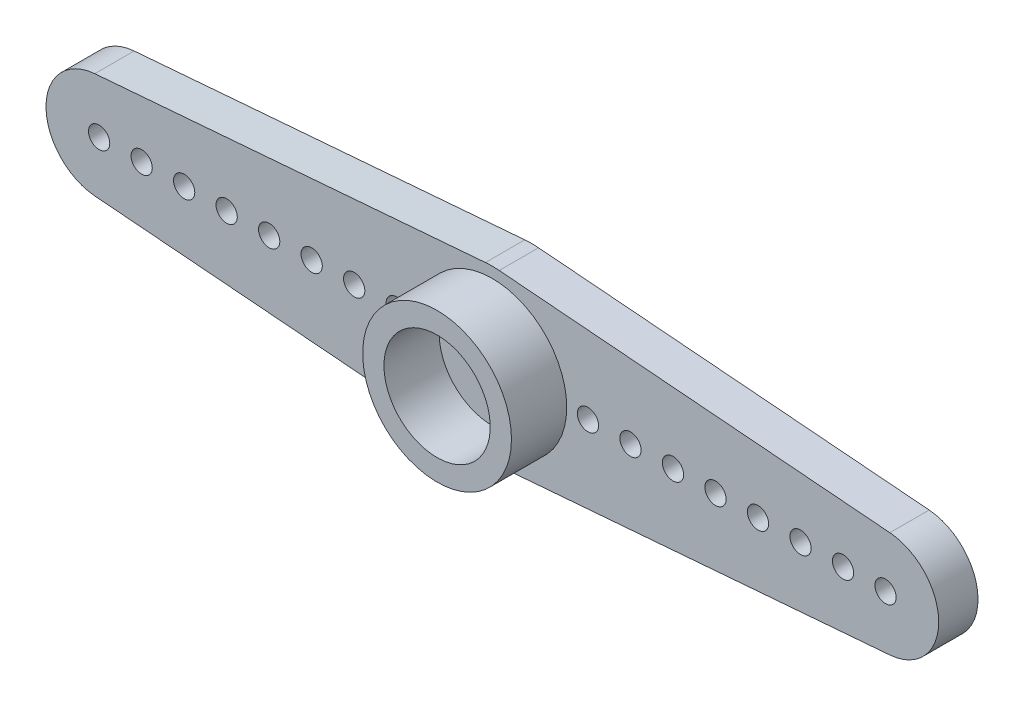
ISO-10303-21;
HEADER;
FILE_DESCRIPTION(('STEP AP214'),'2;1');
FILE_NAME('part.step','',(''),(''),'','','');
FILE_SCHEMA(('AUTOMOTIVE_DESIGN { 1 0 10303 214 1 1 1 1 }'));
ENDSEC;
DATA;
#1=APPLICATION_CONTEXT('core data for automotive mechanical design processes');
#2=APPLICATION_PROTOCOL_DEFINITION('international standard','automotive_design',2000,#1);
#3=PRODUCT_CONTEXT('',#1,'mechanical');
#4=PRODUCT('Part','Part','',(#3));
#5=PRODUCT_RELATED_PRODUCT_CATEGORY('part','',(#4));
#6=PRODUCT_DEFINITION_FORMATION('','',#4);
#7=PRODUCT_DEFINITION_CONTEXT('part definition',#1,'design');
#8=PRODUCT_DEFINITION('design','',#6,#7);
#9=PRODUCT_DEFINITION_SHAPE('','',#8);
#10=(LENGTH_UNIT() NAMED_UNIT(*) SI_UNIT(.MILLI.,.METRE.));
#11=(NAMED_UNIT(*) PLANE_ANGLE_UNIT() SI_UNIT($,.RADIAN.));
#12=(NAMED_UNIT(*) SI_UNIT($,.STERADIAN.) SOLID_ANGLE_UNIT());
#13=UNCERTAINTY_MEASURE_WITH_UNIT(LENGTH_MEASURE(1.E-05),#10,'distance_accuracy_value','');
#14=(GEOMETRIC_REPRESENTATION_CONTEXT(3) GLOBAL_UNCERTAINTY_ASSIGNED_CONTEXT((#13)) GLOBAL_UNIT_ASSIGNED_CONTEXT((#10,
#11,#12)) REPRESENTATION_CONTEXT('',''));
#15=CARTESIAN_POINT('',(0.,0.,0.));
#16=DIRECTION('',(0.,0.,1.));
#17=DIRECTION('',(1.,0.,0.));
#18=AXIS2_PLACEMENT_3D('',#15,#16,#17);
#19=CARTESIAN_POINT('',(0.,0.,0.));
#20=DIRECTION('',(0.,0.,1.));
#21=DIRECTION('',(1.,0.,0.));
#22=AXIS2_PLACEMENT_3D('',#19,#20,#21);
#23=PLANE('',#22);
#24=CARTESIAN_POINT('',(0.,0.,0.));
#25=DIRECTION('',(0.,0.,1.));
#26=DIRECTION('',(1.,0.,0.));
#27=AXIS2_PLACEMENT_3D('',#24,#25,#26);
#28=CIRCLE('',#27,4.);
#29=CARTESIAN_POINT('',(0.324324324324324,3.98683003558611,0.));
#30=VERTEX_POINT('',#29);
#31=CARTESIAN_POINT('',(-0.324324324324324,3.98683003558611,0.));
#32=VERTEX_POINT('',#31);
#33=EDGE_CURVE('E133',#30,#32,#28,.T.);
#34=ORIENTED_EDGE('',*,*,#33,.F.);
#35=DIRECTION('',(-0.996707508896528,0.0810810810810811,0.));
#36=VECTOR('',#35,1.);
#37=CARTESIAN_POINT('',(0.324324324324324,3.98683003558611,0.));
#38=LINE('',#37,#36);
#39=CARTESIAN_POINT('',(18.7027027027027,2.49176877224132,0.));
#40=VERTEX_POINT('',#39);
#41=EDGE_CURVE('E86',#40,#30,#38,.T.);
#42=ORIENTED_EDGE('',*,*,#41,.F.);
#43=CARTESIAN_POINT('',(18.5,0.,0.));
#44=DIRECTION('',(0.,0.,1.));
#45=DIRECTION('',(1.,0.,0.));
#46=AXIS2_PLACEMENT_3D('',#43,#44,#45);
#47=CIRCLE('',#46,2.5);
#48=CARTESIAN_POINT('',(18.7027027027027,-2.49176877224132,0.));
#49=VERTEX_POINT('',#48);
#50=EDGE_CURVE('E80',#49,#40,#47,.T.);
#51=ORIENTED_EDGE('',*,*,#50,.F.);
#52=DIRECTION('',(0.996707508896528,0.0810810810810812,0.));
#53=VECTOR('',#52,1.);
#54=CARTESIAN_POINT('',(18.7027027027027,-2.49176877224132,0.));
#55=LINE('',#54,#53);
#56=CARTESIAN_POINT('',(0.324324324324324,-3.98683003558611,0.));
#57=VERTEX_POINT('',#56);
#58=EDGE_CURVE('E123',#57,#49,#55,.T.);
#59=ORIENTED_EDGE('',*,*,#58,.F.);
#60=CARTESIAN_POINT('',(0.,0.,0.));
#61=DIRECTION('',(0.,0.,1.));
#62=DIRECTION('',(1.,0.,0.));
#63=AXIS2_PLACEMENT_3D('',#60,#61,#62);
#64=CIRCLE('',#63,4.);
#65=CARTESIAN_POINT('',(-0.324324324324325,-3.98683003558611,0.));
#66=VERTEX_POINT('',#65);
#67=EDGE_CURVE('E143',#66,#57,#64,.T.);
#68=ORIENTED_EDGE('',*,*,#67,.F.);
#69=DIRECTION('',(0.996707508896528,-0.0810810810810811,0.));
#70=VECTOR('',#69,1.);
#71=CARTESIAN_POINT('',(-0.324324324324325,-3.98683003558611,0.));
#72=LINE('',#71,#70);
#73=CARTESIAN_POINT('',(-18.7027027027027,-2.49176877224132,0.));
#74=VERTEX_POINT('',#73);
#75=EDGE_CURVE('E141',#74,#66,#72,.T.);
#76=ORIENTED_EDGE('',*,*,#75,.F.);
#77=CARTESIAN_POINT('',(-18.5,0.,0.));
#78=DIRECTION('',(0.,0.,1.));
#79=DIRECTION('',(1.,0.,0.));
#80=AXIS2_PLACEMENT_3D('',#77,#78,#79);
#81=CIRCLE('',#80,2.5);
#82=CARTESIAN_POINT('',(-18.7027027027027,2.49176877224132,0.));
#83=VERTEX_POINT('',#82);
#84=EDGE_CURVE('E139',#83,#74,#81,.T.);
#85=ORIENTED_EDGE('',*,*,#84,.F.);
#86=DIRECTION('',(-0.996707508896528,-0.0810810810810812,0.));
#87=VECTOR('',#86,1.);
#88=CARTESIAN_POINT('',(-18.7027027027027,2.49176877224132,0.));
#89=LINE('',#88,#87);
#90=EDGE_CURVE('E136',#32,#83,#89,.T.);
#91=ORIENTED_EDGE('',*,*,#90,.F.);
#92=EDGE_LOOP('',(#34,#42,#51,#59,#68,#76,#85,#91));
#93=FACE_BOUND('',#92,.T.);
#94=CARTESIAN_POINT('',(18.5,0.,0.));
#95=DIRECTION('',(0.,0.,1.));
#96=DIRECTION('',(1.,0.,0.));
#97=AXIS2_PLACEMENT_3D('',#94,#95,#96);
#98=CIRCLE('',#97,0.499999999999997);
#99=CARTESIAN_POINT('',(19.,0.,0.));
#100=VERTEX_POINT('',#99);
#101=EDGE_CURVE('E137',#100,#100,#98,.T.);
#102=ORIENTED_EDGE('',*,*,#101,.T.);
#103=EDGE_LOOP('',(#102));
#104=FACE_BOUND('',#103,.T.);
#105=CARTESIAN_POINT('',(16.5,0.,0.));
#106=DIRECTION('',(0.,0.,1.));
#107=DIRECTION('',(1.,0.,0.));
#108=AXIS2_PLACEMENT_3D('',#105,#106,#107);
#109=CIRCLE('',#108,0.499999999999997);
#110=CARTESIAN_POINT('',(17.,0.,0.));
#111=VERTEX_POINT('',#110);
#112=EDGE_CURVE('E190',#111,#111,#109,.T.);
#113=ORIENTED_EDGE('',*,*,#112,.T.);
#114=EDGE_LOOP('',(#113));
#115=FACE_BOUND('',#114,.T.);
#116=CARTESIAN_POINT('',(14.5,0.,0.));
#117=DIRECTION('',(0.,0.,1.));
#118=DIRECTION('',(1.,0.,0.));
#119=AXIS2_PLACEMENT_3D('',#116,#117,#118);
#120=CIRCLE('',#119,0.499999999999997);
#121=CARTESIAN_POINT('',(15.,0.,0.));
#122=VERTEX_POINT('',#121);
#123=EDGE_CURVE('E196',#122,#122,#120,.T.);
#124=ORIENTED_EDGE('',*,*,#123,.T.);
#125=EDGE_LOOP('',(#124));
#126=FACE_BOUND('',#125,.T.);
#127=CARTESIAN_POINT('',(12.5,0.,0.));
#128=DIRECTION('',(0.,0.,1.));
#129=DIRECTION('',(1.,0.,0.));
#130=AXIS2_PLACEMENT_3D('',#127,#128,#129);
#131=CIRCLE('',#130,0.499999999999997);
#132=CARTESIAN_POINT('',(13.,0.,0.));
#133=VERTEX_POINT('',#132);
#134=EDGE_CURVE('E202',#133,#133,#131,.T.);
#135=ORIENTED_EDGE('',*,*,#134,.T.);
#136=EDGE_LOOP('',(#135));
#137=FACE_BOUND('',#136,.T.);
#138=CARTESIAN_POINT('',(10.5,0.,0.));
#139=DIRECTION('',(0.,0.,1.));
#140=DIRECTION('',(1.,0.,0.));
#141=AXIS2_PLACEMENT_3D('',#138,#139,#140);
#142=CIRCLE('',#141,0.499999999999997);
#143=CARTESIAN_POINT('',(11.,0.,0.));
#144=VERTEX_POINT('',#143);
#145=EDGE_CURVE('E208',#144,#144,#142,.T.);
#146=ORIENTED_EDGE('',*,*,#145,.T.);
#147=EDGE_LOOP('',(#146));
#148=FACE_BOUND('',#147,.T.);
#149=CARTESIAN_POINT('',(8.5,0.,0.));
#150=DIRECTION('',(0.,0.,1.));
#151=DIRECTION('',(1.,0.,0.));
#152=AXIS2_PLACEMENT_3D('',#149,#150,#151);
#153=CIRCLE('',#152,0.499999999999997);
#154=CARTESIAN_POINT('',(9.,0.,0.));
#155=VERTEX_POINT('',#154);
#156=EDGE_CURVE('E214',#155,#155,#153,.T.);
#157=ORIENTED_EDGE('',*,*,#156,.T.);
#158=EDGE_LOOP('',(#157));
#159=FACE_BOUND('',#158,.T.);
#160=CARTESIAN_POINT('',(6.5,0.,0.));
#161=DIRECTION('',(0.,0.,1.));
#162=DIRECTION('',(1.,0.,0.));
#163=AXIS2_PLACEMENT_3D('',#160,#161,#162);
#164=CIRCLE('',#163,0.499999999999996);
#165=CARTESIAN_POINT('',(6.99999999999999,0.,0.));
#166=VERTEX_POINT('',#165);
#167=EDGE_CURVE('E220',#166,#166,#164,.T.);
#168=ORIENTED_EDGE('',*,*,#167,.T.);
#169=EDGE_LOOP('',(#168));
#170=FACE_BOUND('',#169,.T.);
#171=CARTESIAN_POINT('',(4.5,0.,0.));
#172=DIRECTION('',(0.,0.,1.));
#173=DIRECTION('',(1.,0.,0.));
#174=AXIS2_PLACEMENT_3D('',#171,#172,#173);
#175=CIRCLE('',#174,0.499999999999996);
#176=CARTESIAN_POINT('',(4.99999999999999,0.,0.));
#177=VERTEX_POINT('',#176);
#178=EDGE_CURVE('E226',#177,#177,#175,.T.);
#179=ORIENTED_EDGE('',*,*,#178,.T.);
#180=EDGE_LOOP('',(#179));
#181=FACE_BOUND('',#180,.T.);
#182=CARTESIAN_POINT('',(-4.49999999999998,0.,0.));
#183=DIRECTION('',(0.,0.,1.));
#184=DIRECTION('',(1.,0.,0.));
#185=AXIS2_PLACEMENT_3D('',#182,#183,#184);
#186=CIRCLE('',#185,0.499999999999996);
#187=CARTESIAN_POINT('',(-3.99999999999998,0.,0.));
#188=VERTEX_POINT('',#187);
#189=EDGE_CURVE('E232',#188,#188,#186,.T.);
#190=ORIENTED_EDGE('',*,*,#189,.T.);
#191=EDGE_LOOP('',(#190));
#192=FACE_BOUND('',#191,.T.);
#193=CARTESIAN_POINT('',(-6.49999999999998,0.,0.));
#194=DIRECTION('',(0.,0.,1.));
#195=DIRECTION('',(1.,0.,0.));
#196=AXIS2_PLACEMENT_3D('',#193,#194,#195);
#197=CIRCLE('',#196,0.499999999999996);
#198=CARTESIAN_POINT('',(-5.99999999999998,0.,0.));
#199=VERTEX_POINT('',#198);
#200=EDGE_CURVE('E238',#199,#199,#197,.T.);
#201=ORIENTED_EDGE('',*,*,#200,.T.);
#202=EDGE_LOOP('',(#201));
#203=FACE_BOUND('',#202,.T.);
#204=CARTESIAN_POINT('',(-8.49999999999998,0.,0.));
#205=DIRECTION('',(0.,0.,1.));
#206=DIRECTION('',(1.,0.,0.));
#207=AXIS2_PLACEMENT_3D('',#204,#205,#206);
#208=CIRCLE('',#207,0.499999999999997);
#209=CARTESIAN_POINT('',(-7.99999999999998,0.,0.));
#210=VERTEX_POINT('',#209);
#211=EDGE_CURVE('E244',#210,#210,#208,.T.);
#212=ORIENTED_EDGE('',*,*,#211,.T.);
#213=EDGE_LOOP('',(#212));
#214=FACE_BOUND('',#213,.T.);
#215=CARTESIAN_POINT('',(-10.5,0.,0.));
#216=DIRECTION('',(0.,0.,1.));
#217=DIRECTION('',(1.,0.,0.));
#218=AXIS2_PLACEMENT_3D('',#215,#216,#217);
#219=CIRCLE('',#218,0.499999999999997);
#220=CARTESIAN_POINT('',(-9.99999999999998,0.,0.));
#221=VERTEX_POINT('',#220);
#222=EDGE_CURVE('E250',#221,#221,#219,.T.);
#223=ORIENTED_EDGE('',*,*,#222,.T.);
#224=EDGE_LOOP('',(#223));
#225=FACE_BOUND('',#224,.T.);
#226=CARTESIAN_POINT('',(-12.5,0.,0.));
#227=DIRECTION('',(0.,0.,1.));
#228=DIRECTION('',(1.,0.,0.));
#229=AXIS2_PLACEMENT_3D('',#226,#227,#228);
#230=CIRCLE('',#229,0.499999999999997);
#231=CARTESIAN_POINT('',(-12.,0.,0.));
#232=VERTEX_POINT('',#231);
#233=EDGE_CURVE('E256',#232,#232,#230,.T.);
#234=ORIENTED_EDGE('',*,*,#233,.T.);
#235=EDGE_LOOP('',(#234));
#236=FACE_BOUND('',#235,.T.);
#237=CARTESIAN_POINT('',(-14.5,0.,0.));
#238=DIRECTION('',(0.,0.,1.));
#239=DIRECTION('',(1.,0.,0.));
#240=AXIS2_PLACEMENT_3D('',#237,#238,#239);
#241=CIRCLE('',#240,0.499999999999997);
#242=CARTESIAN_POINT('',(-14.,0.,0.));
#243=VERTEX_POINT('',#242);
#244=EDGE_CURVE('E262',#243,#243,#241,.T.);
#245=ORIENTED_EDGE('',*,*,#244,.T.);
#246=EDGE_LOOP('',(#245));
#247=FACE_BOUND('',#246,.T.);
#248=CARTESIAN_POINT('',(-16.5,0.,0.));
#249=DIRECTION('',(0.,0.,1.));
#250=DIRECTION('',(1.,0.,0.));
#251=AXIS2_PLACEMENT_3D('',#248,#249,#250);
#252=CIRCLE('',#251,0.499999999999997);
#253=CARTESIAN_POINT('',(-16.,0.,0.));
#254=VERTEX_POINT('',#253);
#255=EDGE_CURVE('E268',#254,#254,#252,.T.);
#256=ORIENTED_EDGE('',*,*,#255,.T.);
#257=EDGE_LOOP('',(#256));
#258=FACE_BOUND('',#257,.T.);
#259=CARTESIAN_POINT('',(-18.5,0.,0.));
#260=DIRECTION('',(0.,0.,1.));
#261=DIRECTION('',(1.,0.,0.));
#262=AXIS2_PLACEMENT_3D('',#259,#260,#261);
#263=CIRCLE('',#262,0.499999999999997);
#264=CARTESIAN_POINT('',(-18.,0.,0.));
#265=VERTEX_POINT('',#264);
#266=EDGE_CURVE('E274',#265,#265,#263,.T.);
#267=ORIENTED_EDGE('',*,*,#266,.T.);
#268=EDGE_LOOP('',(#267));
#269=FACE_BOUND('',#268,.T.);
#270=CARTESIAN_POINT('',(0.,0.,0.));
#271=DIRECTION('',(0.,0.,1.));
#272=DIRECTION('',(1.,0.,0.));
#273=AXIS2_PLACEMENT_3D('',#270,#271,#272);
#274=CIRCLE('',#273,2.75);
#275=CARTESIAN_POINT('',(2.75,0.,0.));
#276=VERTEX_POINT('',#275);
#277=EDGE_CURVE('E11',#276,#276,#274,.F.);
#278=ORIENTED_EDGE('',*,*,#277,.F.);
#279=EDGE_LOOP('',(#278));
#280=FACE_BOUND('',#279,.T.);
#281=ADVANCED_FACE('F34',(#93,#104,#115,#126,#137,#148,#159,#170,#181,#192,#203,#214,#225,#236,
#247,#258,#269,#280),#23,.F.);
#282=CARTESIAN_POINT('',(0.,0.,1.85));
#283=DIRECTION('',(0.,0.,1.));
#284=DIRECTION('',(1.,0.,0.));
#285=AXIS2_PLACEMENT_3D('',#282,#283,#284);
#286=PLANE('',#285);
#287=CARTESIAN_POINT('',(0.,0.,1.85));
#288=DIRECTION('',(0.,0.,1.));
#289=DIRECTION('',(1.,0.,0.));
#290=AXIS2_PLACEMENT_3D('',#287,#288,#289);
#291=CIRCLE('',#290,4.);
#292=CARTESIAN_POINT('',(0.324324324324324,3.98683003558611,1.85));
#293=VERTEX_POINT('',#292);
#294=CARTESIAN_POINT('',(-0.324324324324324,3.98683003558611,1.85));
#295=VERTEX_POINT('',#294);
#296=EDGE_CURVE('E148',#293,#295,#291,.T.);
#297=ORIENTED_EDGE('',*,*,#296,.T.);
#298=DIRECTION('',(-0.996707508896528,-0.0810810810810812,0.));
#299=VECTOR('',#298,1.);
#300=CARTESIAN_POINT('',(-18.7027027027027,2.49176877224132,1.85));
#301=LINE('',#300,#299);
#302=CARTESIAN_POINT('',(-18.7027027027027,2.49176877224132,1.85));
#303=VERTEX_POINT('',#302);
#304=EDGE_CURVE('E95',#295,#303,#301,.T.);
#305=ORIENTED_EDGE('',*,*,#304,.T.);
#306=CARTESIAN_POINT('',(-18.5,0.,1.85));
#307=DIRECTION('',(0.,0.,1.));
#308=DIRECTION('',(1.,0.,0.));
#309=AXIS2_PLACEMENT_3D('',#306,#307,#308);
#310=CIRCLE('',#309,2.5);
#311=CARTESIAN_POINT('',(-18.7027027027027,-2.49176877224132,1.85));
#312=VERTEX_POINT('',#311);
#313=EDGE_CURVE('E179',#303,#312,#310,.T.);
#314=ORIENTED_EDGE('',*,*,#313,.T.);
#315=DIRECTION('',(0.996707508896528,-0.0810810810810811,0.));
#316=VECTOR('',#315,1.);
#317=CARTESIAN_POINT('',(-0.324324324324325,-3.98683003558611,1.85));
#318=LINE('',#317,#316);
#319=CARTESIAN_POINT('',(-0.324324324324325,-3.98683003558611,1.85));
#320=VERTEX_POINT('',#319);
#321=EDGE_CURVE('E178',#312,#320,#318,.T.);
#322=ORIENTED_EDGE('',*,*,#321,.T.);
#323=CARTESIAN_POINT('',(0.,0.,1.85));
#324=DIRECTION('',(0.,0.,1.));
#325=DIRECTION('',(1.,0.,0.));
#326=AXIS2_PLACEMENT_3D('',#323,#324,#325);
#327=CIRCLE('',#326,4.);
#328=CARTESIAN_POINT('',(0.324324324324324,-3.98683003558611,1.85));
#329=VERTEX_POINT('',#328);
#330=EDGE_CURVE('E115',#320,#329,#327,.T.);
#331=ORIENTED_EDGE('',*,*,#330,.T.);
#332=DIRECTION('',(0.996707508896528,0.0810810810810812,0.));
#333=VECTOR('',#332,1.);
#334=CARTESIAN_POINT('',(18.7027027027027,-2.49176877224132,1.85));
#335=LINE('',#334,#333);
#336=CARTESIAN_POINT('',(18.7027027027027,-2.49176877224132,1.85));
#337=VERTEX_POINT('',#336);
#338=EDGE_CURVE('E108',#329,#337,#335,.T.);
#339=ORIENTED_EDGE('',*,*,#338,.T.);
#340=CARTESIAN_POINT('',(18.5,0.,1.85));
#341=DIRECTION('',(0.,0.,1.));
#342=DIRECTION('',(1.,0.,0.));
#343=AXIS2_PLACEMENT_3D('',#340,#341,#342);
#344=CIRCLE('',#343,2.5);
#345=CARTESIAN_POINT('',(18.7027027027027,2.49176877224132,1.85));
#346=VERTEX_POINT('',#345);
#347=EDGE_CURVE('E113',#337,#346,#344,.T.);
#348=ORIENTED_EDGE('',*,*,#347,.T.);
#349=DIRECTION('',(-0.996707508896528,0.0810810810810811,0.));
#350=VECTOR('',#349,1.);
#351=CARTESIAN_POINT('',(0.324324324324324,3.98683003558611,1.85));
#352=LINE('',#351,#350);
#353=EDGE_CURVE('E51',#346,#293,#352,.T.);
#354=ORIENTED_EDGE('',*,*,#353,.T.);
#355=EDGE_LOOP('',(#297,#305,#314,#322,#331,#339,#348,#354));
#356=FACE_BOUND('',#355,.T.);
#357=CARTESIAN_POINT('',(18.5,0.,1.85));
#358=DIRECTION('',(0.,0.,1.));
#359=DIRECTION('',(1.,0.,0.));
#360=AXIS2_PLACEMENT_3D('',#357,#358,#359);
#361=CIRCLE('',#360,0.499999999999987);
#362=CARTESIAN_POINT('',(19.,0.,1.85));
#363=VERTEX_POINT('',#362);
#364=EDGE_CURVE('E187',#363,#363,#361,.T.);
#365=ORIENTED_EDGE('',*,*,#364,.F.);
#366=EDGE_LOOP('',(#365));
#367=FACE_BOUND('',#366,.T.);
#368=CARTESIAN_POINT('',(16.5,0.,1.85));
#369=DIRECTION('',(0.,0.,1.));
#370=DIRECTION('',(1.,0.,0.));
#371=AXIS2_PLACEMENT_3D('',#368,#369,#370);
#372=CIRCLE('',#371,0.499999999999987);
#373=CARTESIAN_POINT('',(17.,0.,1.85));
#374=VERTEX_POINT('',#373);
#375=EDGE_CURVE('E193',#374,#374,#372,.T.);
#376=ORIENTED_EDGE('',*,*,#375,.F.);
#377=EDGE_LOOP('',(#376));
#378=FACE_BOUND('',#377,.T.);
#379=CARTESIAN_POINT('',(14.5,0.,1.85));
#380=DIRECTION('',(0.,0.,1.));
#381=DIRECTION('',(1.,0.,0.));
#382=AXIS2_PLACEMENT_3D('',#379,#380,#381);
#383=CIRCLE('',#382,0.499999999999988);
#384=CARTESIAN_POINT('',(15.,0.,1.85));
#385=VERTEX_POINT('',#384);
#386=EDGE_CURVE('E199',#385,#385,#383,.T.);
#387=ORIENTED_EDGE('',*,*,#386,.F.);
#388=EDGE_LOOP('',(#387));
#389=FACE_BOUND('',#388,.T.);
#390=CARTESIAN_POINT('',(12.5,0.,1.85));
#391=DIRECTION('',(0.,0.,1.));
#392=DIRECTION('',(1.,0.,0.));
#393=AXIS2_PLACEMENT_3D('',#390,#391,#392);
#394=CIRCLE('',#393,0.499999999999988);
#395=CARTESIAN_POINT('',(13.,0.,1.85));
#396=VERTEX_POINT('',#395);
#397=EDGE_CURVE('E205',#396,#396,#394,.T.);
#398=ORIENTED_EDGE('',*,*,#397,.F.);
#399=EDGE_LOOP('',(#398));
#400=FACE_BOUND('',#399,.T.);
#401=CARTESIAN_POINT('',(10.5,0.,1.85));
#402=DIRECTION('',(0.,0.,1.));
#403=DIRECTION('',(1.,0.,0.));
#404=AXIS2_PLACEMENT_3D('',#401,#402,#403);
#405=CIRCLE('',#404,0.499999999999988);
#406=CARTESIAN_POINT('',(11.,0.,1.85));
#407=VERTEX_POINT('',#406);
#408=EDGE_CURVE('E211',#407,#407,#405,.T.);
#409=ORIENTED_EDGE('',*,*,#408,.F.);
#410=EDGE_LOOP('',(#409));
#411=FACE_BOUND('',#410,.T.);
#412=CARTESIAN_POINT('',(8.5,0.,1.85));
#413=DIRECTION('',(0.,0.,1.));
#414=DIRECTION('',(1.,0.,0.));
#415=AXIS2_PLACEMENT_3D('',#412,#413,#414);
#416=CIRCLE('',#415,0.499999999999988);
#417=CARTESIAN_POINT('',(8.99999999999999,0.,1.85));
#418=VERTEX_POINT('',#417);
#419=EDGE_CURVE('E217',#418,#418,#416,.T.);
#420=ORIENTED_EDGE('',*,*,#419,.F.);
#421=EDGE_LOOP('',(#420));
#422=FACE_BOUND('',#421,.T.);
#423=CARTESIAN_POINT('',(6.5,0.,1.85));
#424=DIRECTION('',(0.,0.,1.));
#425=DIRECTION('',(1.,0.,0.));
#426=AXIS2_PLACEMENT_3D('',#423,#424,#425);
#427=CIRCLE('',#426,0.499999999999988);
#428=CARTESIAN_POINT('',(6.99999999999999,0.,1.85));
#429=VERTEX_POINT('',#428);
#430=EDGE_CURVE('E223',#429,#429,#427,.T.);
#431=ORIENTED_EDGE('',*,*,#430,.F.);
#432=EDGE_LOOP('',(#431));
#433=FACE_BOUND('',#432,.T.);
#434=CARTESIAN_POINT('',(4.5,0.,1.85));
#435=DIRECTION('',(0.,0.,1.));
#436=DIRECTION('',(1.,0.,0.));
#437=AXIS2_PLACEMENT_3D('',#434,#435,#436);
#438=CIRCLE('',#437,0.499999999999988);
#439=CARTESIAN_POINT('',(4.99999999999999,0.,1.85));
#440=VERTEX_POINT('',#439);
#441=EDGE_CURVE('E229',#440,#440,#438,.T.);
#442=ORIENTED_EDGE('',*,*,#441,.F.);
#443=EDGE_LOOP('',(#442));
#444=FACE_BOUND('',#443,.T.);
#445=CARTESIAN_POINT('',(-4.49999999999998,0.,1.85));
#446=DIRECTION('',(0.,0.,1.));
#447=DIRECTION('',(1.,0.,0.));
#448=AXIS2_PLACEMENT_3D('',#445,#446,#447);
#449=CIRCLE('',#448,0.499999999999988);
#450=CARTESIAN_POINT('',(-3.99999999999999,0.,1.85));
#451=VERTEX_POINT('',#450);
#452=EDGE_CURVE('E235',#451,#451,#449,.T.);
#453=ORIENTED_EDGE('',*,*,#452,.F.);
#454=EDGE_LOOP('',(#453));
#455=FACE_BOUND('',#454,.T.);
#456=CARTESIAN_POINT('',(-6.49999999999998,0.,1.85));
#457=DIRECTION('',(0.,0.,1.));
#458=DIRECTION('',(1.,0.,0.));
#459=AXIS2_PLACEMENT_3D('',#456,#457,#458);
#460=CIRCLE('',#459,0.499999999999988);
#461=CARTESIAN_POINT('',(-5.99999999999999,0.,1.85));
#462=VERTEX_POINT('',#461);
#463=EDGE_CURVE('E241',#462,#462,#460,.T.);
#464=ORIENTED_EDGE('',*,*,#463,.F.);
#465=EDGE_LOOP('',(#464));
#466=FACE_BOUND('',#465,.T.);
#467=CARTESIAN_POINT('',(-8.49999999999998,0.,1.85));
#468=DIRECTION('',(0.,0.,1.));
#469=DIRECTION('',(1.,0.,0.));
#470=AXIS2_PLACEMENT_3D('',#467,#468,#469);
#471=CIRCLE('',#470,0.499999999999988);
#472=CARTESIAN_POINT('',(-7.99999999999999,0.,1.85));
#473=VERTEX_POINT('',#472);
#474=EDGE_CURVE('E247',#473,#473,#471,.T.);
#475=ORIENTED_EDGE('',*,*,#474,.F.);
#476=EDGE_LOOP('',(#475));
#477=FACE_BOUND('',#476,.T.);
#478=CARTESIAN_POINT('',(-10.5,0.,1.85));
#479=DIRECTION('',(0.,0.,1.));
#480=DIRECTION('',(1.,0.,0.));
#481=AXIS2_PLACEMENT_3D('',#478,#479,#480);
#482=CIRCLE('',#481,0.499999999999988);
#483=CARTESIAN_POINT('',(-9.99999999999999,0.,1.85));
#484=VERTEX_POINT('',#483);
#485=EDGE_CURVE('E253',#484,#484,#482,.T.);
#486=ORIENTED_EDGE('',*,*,#485,.F.);
#487=EDGE_LOOP('',(#486));
#488=FACE_BOUND('',#487,.T.);
#489=CARTESIAN_POINT('',(-12.5,0.,1.85));
#490=DIRECTION('',(0.,0.,1.));
#491=DIRECTION('',(1.,0.,0.));
#492=AXIS2_PLACEMENT_3D('',#489,#490,#491);
#493=CIRCLE('',#492,0.499999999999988);
#494=CARTESIAN_POINT('',(-12.,0.,1.85));
#495=VERTEX_POINT('',#494);
#496=EDGE_CURVE('E259',#495,#495,#493,.T.);
#497=ORIENTED_EDGE('',*,*,#496,.F.);
#498=EDGE_LOOP('',(#497));
#499=FACE_BOUND('',#498,.T.);
#500=CARTESIAN_POINT('',(-14.5,0.,1.85));
#501=DIRECTION('',(0.,0.,1.));
#502=DIRECTION('',(1.,0.,0.));
#503=AXIS2_PLACEMENT_3D('',#500,#501,#502);
#504=CIRCLE('',#503,0.499999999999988);
#505=CARTESIAN_POINT('',(-14.,0.,1.85));
#506=VERTEX_POINT('',#505);
#507=EDGE_CURVE('E265',#506,#506,#504,.T.);
#508=ORIENTED_EDGE('',*,*,#507,.F.);
#509=EDGE_LOOP('',(#508));
#510=FACE_BOUND('',#509,.T.);
#511=CARTESIAN_POINT('',(-16.5,0.,1.85));
#512=DIRECTION('',(0.,0.,1.));
#513=DIRECTION('',(1.,0.,0.));
#514=AXIS2_PLACEMENT_3D('',#511,#512,#513);
#515=CIRCLE('',#514,0.499999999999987);
#516=CARTESIAN_POINT('',(-16.,0.,1.85));
#517=VERTEX_POINT('',#516);
#518=EDGE_CURVE('E271',#517,#517,#515,.T.);
#519=ORIENTED_EDGE('',*,*,#518,.F.);
#520=EDGE_LOOP('',(#519));
#521=FACE_BOUND('',#520,.T.);
#522=CARTESIAN_POINT('',(-18.5,0.,1.85));
#523=DIRECTION('',(0.,0.,1.));
#524=DIRECTION('',(1.,0.,0.));
#525=AXIS2_PLACEMENT_3D('',#522,#523,#524);
#526=CIRCLE('',#525,0.499999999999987);
#527=CARTESIAN_POINT('',(-18.,0.,1.85));
#528=VERTEX_POINT('',#527);
#529=EDGE_CURVE('E277',#528,#528,#526,.T.);
#530=ORIENTED_EDGE('',*,*,#529,.F.);
#531=EDGE_LOOP('',(#530));
#532=FACE_BOUND('',#531,.T.);
#533=CARTESIAN_POINT('',(0.,0.,1.85));
#534=DIRECTION('',(0.,0.,1.));
#535=DIRECTION('',(1.,0.,0.));
#536=AXIS2_PLACEMENT_3D('',#533,#534,#535);
#537=CIRCLE('',#536,3.5);
#538=CARTESIAN_POINT('',(3.5,0.,1.85));
#539=VERTEX_POINT('',#538);
#540=EDGE_CURVE('E281',#539,#539,#537,.T.);
#541=ORIENTED_EDGE('',*,*,#540,.F.);
#542=EDGE_LOOP('',(#541));
#543=FACE_BOUND('',#542,.T.);
#544=ADVANCED_FACE('F110',(#356,#367,#378,#389,#400,#411,#422,#433,#444,#455,#466,#477,#488,
#499,#510,#521,#532,#543),#286,.T.);
#545=CARTESIAN_POINT('',(0.,0.,1.85));
#546=DIRECTION('',(0.,0.,-1.));
#547=DIRECTION('',(-1.,0.,0.));
#548=AXIS2_PLACEMENT_3D('',#545,#546,#547);
#549=CYLINDRICAL_SURFACE('',#548,4.);
#550=ORIENTED_EDGE('',*,*,#33,.T.);
#551=DIRECTION('',(0.,0.,-1.));
#552=VECTOR('',#551,1.);
#553=CARTESIAN_POINT('',(-0.324324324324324,3.98683003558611,1.85));
#554=LINE('',#553,#552);
#555=EDGE_CURVE('E43',#295,#32,#554,.T.);
#556=ORIENTED_EDGE('',*,*,#555,.F.);
#557=ORIENTED_EDGE('',*,*,#296,.F.);
#558=DIRECTION('',(0.,0.,-1.));
#559=VECTOR('',#558,1.);
#560=CARTESIAN_POINT('',(0.324324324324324,3.98683003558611,1.85));
#561=LINE('',#560,#559);
#562=EDGE_CURVE('E129',#293,#30,#561,.T.);
#563=ORIENTED_EDGE('',*,*,#562,.T.);
#564=EDGE_LOOP('',(#550,#556,#557,#563));
#565=FACE_BOUND('',#564,.T.);
#566=ADVANCED_FACE('F36',(#565),#549,.T.);
#567=CARTESIAN_POINT('',(-18.7027027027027,2.49176877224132,1.85));
#568=DIRECTION('',(0.0810810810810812,-0.996707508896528,0.));
#569=DIRECTION('',(0.996707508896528,0.0810810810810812,0.));
#570=AXIS2_PLACEMENT_3D('',#567,#568,#569);
#571=PLANE('',#570);
#572=ORIENTED_EDGE('',*,*,#90,.T.);
#573=DIRECTION('',(0.,0.,-1.));
#574=VECTOR('',#573,1.);
#575=CARTESIAN_POINT('',(-18.7027027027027,2.49176877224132,1.85));
#576=LINE('',#575,#574);
#577=EDGE_CURVE('E158',#303,#83,#576,.T.);
#578=ORIENTED_EDGE('',*,*,#577,.F.);
#579=ORIENTED_EDGE('',*,*,#304,.F.);
#580=ORIENTED_EDGE('',*,*,#555,.T.);
#581=EDGE_LOOP('',(#572,#578,#579,#580));
#582=FACE_BOUND('',#581,.T.);
#583=ADVANCED_FACE('F161',(#582),#571,.F.);
#584=CARTESIAN_POINT('',(-18.5,0.,1.85));
#585=DIRECTION('',(0.,0.,-1.));
#586=DIRECTION('',(-1.,0.,0.));
#587=AXIS2_PLACEMENT_3D('',#584,#585,#586);
#588=CYLINDRICAL_SURFACE('',#587,2.5);
#589=ORIENTED_EDGE('',*,*,#84,.T.);
#590=DIRECTION('',(0.,0.,-1.));
#591=VECTOR('',#590,1.);
#592=CARTESIAN_POINT('',(-18.7027027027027,-2.49176877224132,1.85));
#593=LINE('',#592,#591);
#594=EDGE_CURVE('E155',#312,#74,#593,.T.);
#595=ORIENTED_EDGE('',*,*,#594,.F.);
#596=ORIENTED_EDGE('',*,*,#313,.F.);
#597=ORIENTED_EDGE('',*,*,#577,.T.);
#598=EDGE_LOOP('',(#589,#595,#596,#597));
#599=FACE_BOUND('',#598,.T.);
#600=ADVANCED_FACE('F172',(#599),#588,.T.);
#601=CARTESIAN_POINT('',(-0.324324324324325,-3.98683003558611,1.85));
#602=DIRECTION('',(0.0810810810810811,0.996707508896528,0.));
#603=DIRECTION('',(-0.996707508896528,0.0810810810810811,0.));
#604=AXIS2_PLACEMENT_3D('',#601,#602,#603);
#605=PLANE('',#604);
#606=ORIENTED_EDGE('',*,*,#75,.T.);
#607=DIRECTION('',(0.,0.,-1.));
#608=VECTOR('',#607,1.);
#609=CARTESIAN_POINT('',(-0.324324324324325,-3.98683003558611,1.85));
#610=LINE('',#609,#608);
#611=EDGE_CURVE('E152',#320,#66,#610,.T.);
#612=ORIENTED_EDGE('',*,*,#611,.F.);
#613=ORIENTED_EDGE('',*,*,#321,.F.);
#614=ORIENTED_EDGE('',*,*,#594,.T.);
#615=EDGE_LOOP('',(#606,#612,#613,#614));
#616=FACE_BOUND('',#615,.T.);
#617=ADVANCED_FACE('F176',(#616),#605,.F.);
#618=CARTESIAN_POINT('',(0.,0.,1.85));
#619=DIRECTION('',(0.,0.,-1.));
#620=DIRECTION('',(-1.,0.,0.));
#621=AXIS2_PLACEMENT_3D('',#618,#619,#620);
#622=CYLINDRICAL_SURFACE('',#621,4.);
#623=ORIENTED_EDGE('',*,*,#67,.T.);
#624=DIRECTION('',(0.,0.,-1.));
#625=VECTOR('',#624,1.);
#626=CARTESIAN_POINT('',(0.324324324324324,-3.98683003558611,1.85));
#627=LINE('',#626,#625);
#628=EDGE_CURVE('E124',#329,#57,#627,.T.);
#629=ORIENTED_EDGE('',*,*,#628,.F.);
#630=ORIENTED_EDGE('',*,*,#330,.F.);
#631=ORIENTED_EDGE('',*,*,#611,.T.);
#632=EDGE_LOOP('',(#623,#629,#630,#631));
#633=FACE_BOUND('',#632,.T.);
#634=ADVANCED_FACE('F369',(#633),#622,.T.);
#635=CARTESIAN_POINT('',(18.7027027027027,-2.49176877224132,1.85));
#636=DIRECTION('',(-0.0810810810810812,0.996707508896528,0.));
#637=DIRECTION('',(-0.996707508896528,-0.0810810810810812,0.));
#638=AXIS2_PLACEMENT_3D('',#635,#636,#637);
#639=PLANE('',#638);
#640=ORIENTED_EDGE('',*,*,#58,.T.);
#641=DIRECTION('',(0.,0.,-1.));
#642=VECTOR('',#641,1.);
#643=CARTESIAN_POINT('',(18.7027027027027,-2.49176877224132,1.85));
#644=LINE('',#643,#642);
#645=EDGE_CURVE('E120',#337,#49,#644,.T.);
#646=ORIENTED_EDGE('',*,*,#645,.F.);
#647=ORIENTED_EDGE('',*,*,#338,.F.);
#648=ORIENTED_EDGE('',*,*,#628,.T.);
#649=EDGE_LOOP('',(#640,#646,#647,#648));
#650=FACE_BOUND('',#649,.T.);
#651=ADVANCED_FACE('F121',(#650),#639,.F.);
#652=CARTESIAN_POINT('',(18.5,0.,1.85));
#653=DIRECTION('',(0.,0.,-1.));
#654=DIRECTION('',(-1.,0.,0.));
#655=AXIS2_PLACEMENT_3D('',#652,#653,#654);
#656=CYLINDRICAL_SURFACE('',#655,2.5);
#657=ORIENTED_EDGE('',*,*,#50,.T.);
#658=DIRECTION('',(0.,0.,-1.));
#659=VECTOR('',#658,1.);
#660=CARTESIAN_POINT('',(18.7027027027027,2.49176877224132,1.85));
#661=LINE('',#660,#659);
#662=EDGE_CURVE('E125',#346,#40,#661,.T.);
#663=ORIENTED_EDGE('',*,*,#662,.F.);
#664=ORIENTED_EDGE('',*,*,#347,.F.);
#665=ORIENTED_EDGE('',*,*,#645,.T.);
#666=EDGE_LOOP('',(#657,#663,#664,#665));
#667=FACE_BOUND('',#666,.T.);
#668=ADVANCED_FACE('F127',(#667),#656,.T.);
#669=CARTESIAN_POINT('',(0.324324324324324,3.98683003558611,1.85));
#670=DIRECTION('',(-0.0810810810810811,-0.996707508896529,0.));
#671=DIRECTION('',(0.996707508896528,-0.0810810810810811,0.));
#672=AXIS2_PLACEMENT_3D('',#669,#670,#671);
#673=PLANE('',#672);
#674=ORIENTED_EDGE('',*,*,#41,.T.);
#675=ORIENTED_EDGE('',*,*,#562,.F.);
#676=ORIENTED_EDGE('',*,*,#353,.F.);
#677=ORIENTED_EDGE('',*,*,#662,.T.);
#678=EDGE_LOOP('',(#674,#675,#676,#677));
#679=FACE_BOUND('',#678,.T.);
#680=ADVANCED_FACE('F361',(#679),#673,.F.);
#681=CARTESIAN_POINT('',(18.5,0.,1.85));
#682=DIRECTION('',(0.,0.,1.));
#683=DIRECTION('',(1.,0.,0.));
#684=AXIS2_PLACEMENT_3D('',#681,#682,#683);
#685=CYLINDRICAL_SURFACE('',#684,0.499999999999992);
#686=ORIENTED_EDGE('',*,*,#101,.F.);
#687=EDGE_LOOP('',(#686));
#688=FACE_BOUND('',#687,.T.);
#689=ORIENTED_EDGE('',*,*,#364,.T.);
#690=EDGE_LOOP('',(#689));
#691=FACE_BOUND('',#690,.T.);
#692=ADVANCED_FACE('F364',(#688,#691),#685,.F.);
#693=CARTESIAN_POINT('',(16.5,0.,1.85));
#694=DIRECTION('',(0.,0.,1.));
#695=DIRECTION('',(1.,0.,0.));
#696=AXIS2_PLACEMENT_3D('',#693,#694,#695);
#697=CYLINDRICAL_SURFACE('',#696,0.499999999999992);
#698=ORIENTED_EDGE('',*,*,#112,.F.);
#699=EDGE_LOOP('',(#698));
#700=FACE_BOUND('',#699,.T.);
#701=ORIENTED_EDGE('',*,*,#375,.T.);
#702=EDGE_LOOP('',(#701));
#703=FACE_BOUND('',#702,.T.);
#704=ADVANCED_FACE('F514',(#700,#703),#697,.F.);
#705=CARTESIAN_POINT('',(14.5,0.,1.85));
#706=DIRECTION('',(0.,0.,1.));
#707=DIRECTION('',(1.,0.,0.));
#708=AXIS2_PLACEMENT_3D('',#705,#706,#707);
#709=CYLINDRICAL_SURFACE('',#708,0.499999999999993);
#710=ORIENTED_EDGE('',*,*,#123,.F.);
#711=EDGE_LOOP('',(#710));
#712=FACE_BOUND('',#711,.T.);
#713=ORIENTED_EDGE('',*,*,#386,.T.);
#714=EDGE_LOOP('',(#713));
#715=FACE_BOUND('',#714,.T.);
#716=ADVANCED_FACE('F510',(#712,#715),#709,.F.);
#717=CARTESIAN_POINT('',(12.5,0.,1.85));
#718=DIRECTION('',(0.,0.,1.));
#719=DIRECTION('',(1.,0.,0.));
#720=AXIS2_PLACEMENT_3D('',#717,#718,#719);
#721=CYLINDRICAL_SURFACE('',#720,0.499999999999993);
#722=ORIENTED_EDGE('',*,*,#134,.F.);
#723=EDGE_LOOP('',(#722));
#724=FACE_BOUND('',#723,.T.);
#725=ORIENTED_EDGE('',*,*,#397,.T.);
#726=EDGE_LOOP('',(#725));
#727=FACE_BOUND('',#726,.T.);
#728=ADVANCED_FACE('F506',(#724,#727),#721,.F.);
#729=CARTESIAN_POINT('',(10.5,0.,1.85));
#730=DIRECTION('',(0.,0.,1.));
#731=DIRECTION('',(1.,0.,0.));
#732=AXIS2_PLACEMENT_3D('',#729,#730,#731);
#733=CYLINDRICAL_SURFACE('',#732,0.499999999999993);
#734=ORIENTED_EDGE('',*,*,#145,.F.);
#735=EDGE_LOOP('',(#734));
#736=FACE_BOUND('',#735,.T.);
#737=ORIENTED_EDGE('',*,*,#408,.T.);
#738=EDGE_LOOP('',(#737));
#739=FACE_BOUND('',#738,.T.);
#740=ADVANCED_FACE('F502',(#736,#739),#733,.F.);
#741=CARTESIAN_POINT('',(8.5,0.,1.85));
#742=DIRECTION('',(0.,0.,1.));
#743=DIRECTION('',(1.,0.,0.));
#744=AXIS2_PLACEMENT_3D('',#741,#742,#743);
#745=CYLINDRICAL_SURFACE('',#744,0.499999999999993);
#746=ORIENTED_EDGE('',*,*,#156,.F.);
#747=EDGE_LOOP('',(#746));
#748=FACE_BOUND('',#747,.T.);
#749=ORIENTED_EDGE('',*,*,#419,.T.);
#750=EDGE_LOOP('',(#749));
#751=FACE_BOUND('',#750,.T.);
#752=ADVANCED_FACE('F498',(#748,#751),#745,.F.);
#753=CARTESIAN_POINT('',(6.5,0.,1.85));
#754=DIRECTION('',(0.,0.,1.));
#755=DIRECTION('',(1.,0.,0.));
#756=AXIS2_PLACEMENT_3D('',#753,#754,#755);
#757=CYLINDRICAL_SURFACE('',#756,0.499999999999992);
#758=ORIENTED_EDGE('',*,*,#167,.F.);
#759=EDGE_LOOP('',(#758));
#760=FACE_BOUND('',#759,.T.);
#761=ORIENTED_EDGE('',*,*,#430,.T.);
#762=EDGE_LOOP('',(#761));
#763=FACE_BOUND('',#762,.T.);
#764=ADVANCED_FACE('F494',(#760,#763),#757,.F.);
#765=CARTESIAN_POINT('',(4.5,0.,1.85));
#766=DIRECTION('',(0.,0.,1.));
#767=DIRECTION('',(1.,0.,0.));
#768=AXIS2_PLACEMENT_3D('',#765,#766,#767);
#769=CYLINDRICAL_SURFACE('',#768,0.499999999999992);
#770=ORIENTED_EDGE('',*,*,#178,.F.);
#771=EDGE_LOOP('',(#770));
#772=FACE_BOUND('',#771,.T.);
#773=ORIENTED_EDGE('',*,*,#441,.T.);
#774=EDGE_LOOP('',(#773));
#775=FACE_BOUND('',#774,.T.);
#776=ADVANCED_FACE('F490',(#772,#775),#769,.F.);
#777=CARTESIAN_POINT('',(-4.49999999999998,0.,1.85));
#778=DIRECTION('',(0.,0.,1.));
#779=DIRECTION('',(1.,0.,0.));
#780=AXIS2_PLACEMENT_3D('',#777,#778,#779);
#781=CYLINDRICAL_SURFACE('',#780,0.499999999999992);
#782=ORIENTED_EDGE('',*,*,#189,.F.);
#783=EDGE_LOOP('',(#782));
#784=FACE_BOUND('',#783,.T.);
#785=ORIENTED_EDGE('',*,*,#452,.T.);
#786=EDGE_LOOP('',(#785));
#787=FACE_BOUND('',#786,.T.);
#788=ADVANCED_FACE('F486',(#784,#787),#781,.F.);
#789=CARTESIAN_POINT('',(-6.49999999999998,0.,1.85));
#790=DIRECTION('',(0.,0.,1.));
#791=DIRECTION('',(1.,0.,0.));
#792=AXIS2_PLACEMENT_3D('',#789,#790,#791);
#793=CYLINDRICAL_SURFACE('',#792,0.499999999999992);
#794=ORIENTED_EDGE('',*,*,#200,.F.);
#795=EDGE_LOOP('',(#794));
#796=FACE_BOUND('',#795,.T.);
#797=ORIENTED_EDGE('',*,*,#463,.T.);
#798=EDGE_LOOP('',(#797));
#799=FACE_BOUND('',#798,.T.);
#800=ADVANCED_FACE('F482',(#796,#799),#793,.F.);
#801=CARTESIAN_POINT('',(-8.49999999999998,0.,1.85));
#802=DIRECTION('',(0.,0.,1.));
#803=DIRECTION('',(1.,0.,0.));
#804=AXIS2_PLACEMENT_3D('',#801,#802,#803);
#805=CYLINDRICAL_SURFACE('',#804,0.499999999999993);
#806=ORIENTED_EDGE('',*,*,#211,.F.);
#807=EDGE_LOOP('',(#806));
#808=FACE_BOUND('',#807,.T.);
#809=ORIENTED_EDGE('',*,*,#474,.T.);
#810=EDGE_LOOP('',(#809));
#811=FACE_BOUND('',#810,.T.);
#812=ADVANCED_FACE('F478',(#808,#811),#805,.F.);
#813=CARTESIAN_POINT('',(-10.5,0.,1.85));
#814=DIRECTION('',(0.,0.,1.));
#815=DIRECTION('',(1.,0.,0.));
#816=AXIS2_PLACEMENT_3D('',#813,#814,#815);
#817=CYLINDRICAL_SURFACE('',#816,0.499999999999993);
#818=ORIENTED_EDGE('',*,*,#222,.F.);
#819=EDGE_LOOP('',(#818));
#820=FACE_BOUND('',#819,.T.);
#821=ORIENTED_EDGE('',*,*,#485,.T.);
#822=EDGE_LOOP('',(#821));
#823=FACE_BOUND('',#822,.T.);
#824=ADVANCED_FACE('F474',(#820,#823),#817,.F.);
#825=CARTESIAN_POINT('',(-12.5,0.,1.85));
#826=DIRECTION('',(0.,0.,1.));
#827=DIRECTION('',(1.,0.,0.));
#828=AXIS2_PLACEMENT_3D('',#825,#826,#827);
#829=CYLINDRICAL_SURFACE('',#828,0.499999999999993);
#830=ORIENTED_EDGE('',*,*,#233,.F.);
#831=EDGE_LOOP('',(#830));
#832=FACE_BOUND('',#831,.T.);
#833=ORIENTED_EDGE('',*,*,#496,.T.);
#834=EDGE_LOOP('',(#833));
#835=FACE_BOUND('',#834,.T.);
#836=ADVANCED_FACE('F470',(#832,#835),#829,.F.);
#837=CARTESIAN_POINT('',(-14.5,0.,1.85));
#838=DIRECTION('',(0.,0.,1.));
#839=DIRECTION('',(1.,0.,0.));
#840=AXIS2_PLACEMENT_3D('',#837,#838,#839);
#841=CYLINDRICAL_SURFACE('',#840,0.499999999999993);
#842=ORIENTED_EDGE('',*,*,#244,.F.);
#843=EDGE_LOOP('',(#842));
#844=FACE_BOUND('',#843,.T.);
#845=ORIENTED_EDGE('',*,*,#507,.T.);
#846=EDGE_LOOP('',(#845));
#847=FACE_BOUND('',#846,.T.);
#848=ADVANCED_FACE('F466',(#844,#847),#841,.F.);
#849=CARTESIAN_POINT('',(-16.5,0.,1.85));
#850=DIRECTION('',(0.,0.,1.));
#851=DIRECTION('',(1.,0.,0.));
#852=AXIS2_PLACEMENT_3D('',#849,#850,#851);
#853=CYLINDRICAL_SURFACE('',#852,0.499999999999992);
#854=ORIENTED_EDGE('',*,*,#255,.F.);
#855=EDGE_LOOP('',(#854));
#856=FACE_BOUND('',#855,.T.);
#857=ORIENTED_EDGE('',*,*,#518,.T.);
#858=EDGE_LOOP('',(#857));
#859=FACE_BOUND('',#858,.T.);
#860=ADVANCED_FACE('F462',(#856,#859),#853,.F.);
#861=CARTESIAN_POINT('',(-18.5,0.,1.85));
#862=DIRECTION('',(0.,0.,1.));
#863=DIRECTION('',(1.,0.,0.));
#864=AXIS2_PLACEMENT_3D('',#861,#862,#863);
#865=CYLINDRICAL_SURFACE('',#864,0.499999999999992);
#866=ORIENTED_EDGE('',*,*,#266,.F.);
#867=EDGE_LOOP('',(#866));
#868=FACE_BOUND('',#867,.T.);
#869=ORIENTED_EDGE('',*,*,#529,.T.);
#870=EDGE_LOOP('',(#869));
#871=FACE_BOUND('',#870,.T.);
#872=ADVANCED_FACE('F394',(#868,#871),#865,.F.);
#873=CARTESIAN_POINT('',(0.,0.,4.45));
#874=DIRECTION('',(0.,0.,-1.));
#875=DIRECTION('',(-1.,0.,0.));
#876=AXIS2_PLACEMENT_3D('',#873,#874,#875);
#877=CYLINDRICAL_SURFACE('',#876,3.5);
#878=CARTESIAN_POINT('',(0.,0.,4.45));
#879=DIRECTION('',(0.,0.,1.));
#880=DIRECTION('',(1.,0.,0.));
#881=AXIS2_PLACEMENT_3D('',#878,#879,#880);
#882=CIRCLE('',#881,3.5);
#883=CARTESIAN_POINT('',(3.5,0.,4.45));
#884=VERTEX_POINT('',#883);
#885=EDGE_CURVE('E280',#884,#884,#882,.T.);
#886=ORIENTED_EDGE('',*,*,#885,.F.);
#887=EDGE_LOOP('',(#886));
#888=FACE_BOUND('',#887,.T.);
#889=ORIENTED_EDGE('',*,*,#540,.T.);
#890=EDGE_LOOP('',(#889));
#891=FACE_BOUND('',#890,.T.);
#892=ADVANCED_FACE('F398',(#888,#891),#877,.T.);
#893=CARTESIAN_POINT('',(0.,0.,4.45));
#894=DIRECTION('',(0.,0.,1.));
#895=DIRECTION('',(1.,0.,0.));
#896=AXIS2_PLACEMENT_3D('',#893,#894,#895);
#897=PLANE('',#896);
#898=CARTESIAN_POINT('',(0.,0.,4.45));
#899=DIRECTION('',(0.,0.,-1.));
#900=DIRECTION('',(-1.,0.,0.));
#901=AXIS2_PLACEMENT_3D('',#898,#899,#900);
#902=CIRCLE('',#901,2.5);
#903=CARTESIAN_POINT('',(-2.5,0.,4.45));
#904=VERTEX_POINT('',#903);
#905=EDGE_CURVE('E304',#904,#904,#902,.T.);
#906=ORIENTED_EDGE('',*,*,#905,.T.);
#907=EDGE_LOOP('',(#906));
#908=FACE_BOUND('',#907,.T.);
#909=ORIENTED_EDGE('',*,*,#885,.T.);
#910=EDGE_LOOP('',(#909));
#911=FACE_BOUND('',#910,.T.);
#912=ADVANCED_FACE('F308',(#908,#911),#897,.T.);
#913=CARTESIAN_POINT('',(0.,0.,-0.5));
#914=DIRECTION('',(0.,0.,1.));
#915=DIRECTION('',(1.,0.,0.));
#916=AXIS2_PLACEMENT_3D('',#913,#914,#915);
#917=CYLINDRICAL_SURFACE('',#916,2.75);
#918=CARTESIAN_POINT('',(0.,0.,-0.5));
#919=DIRECTION('',(0.,0.,-1.));
#920=DIRECTION('',(-1.,0.,0.));
#921=AXIS2_PLACEMENT_3D('',#918,#919,#920);
#922=CIRCLE('',#921,2.75);
#923=CARTESIAN_POINT('',(-2.75,0.,-0.5));
#924=VERTEX_POINT('',#923);
#925=EDGE_CURVE('E284',#924,#924,#922,.T.);
#926=ORIENTED_EDGE('',*,*,#925,.F.);
#927=EDGE_LOOP('',(#926));
#928=FACE_BOUND('',#927,.T.);
#929=ORIENTED_EDGE('',*,*,#277,.T.);
#930=EDGE_LOOP('',(#929));
#931=FACE_BOUND('',#930,.T.);
#932=ADVANCED_FACE('F344',(#928,#931),#917,.T.);
#933=CARTESIAN_POINT('',(0.,0.,-0.5));
#934=DIRECTION('',(0.,0.,-1.));
#935=DIRECTION('',(-1.,0.,0.));
#936=AXIS2_PLACEMENT_3D('',#933,#934,#935);
#937=PLANE('',#936);
#938=CARTESIAN_POINT('',(0.,0.,-0.5));
#939=DIRECTION('',(0.,0.,-1.));
#940=DIRECTION('',(-1.,0.,0.));
#941=AXIS2_PLACEMENT_3D('',#938,#939,#940);
#942=CIRCLE('',#941,2.2);
#943=CARTESIAN_POINT('',(-2.2,0.,-0.5));
#944=VERTEX_POINT('',#943);
#945=EDGE_CURVE('E289',#944,#944,#942,.T.);
#946=ORIENTED_EDGE('',*,*,#945,.F.);
#947=EDGE_LOOP('',(#946));
#948=FACE_BOUND('',#947,.T.);
#949=ORIENTED_EDGE('',*,*,#925,.T.);
#950=EDGE_LOOP('',(#949));
#951=FACE_BOUND('',#950,.T.);
#952=ADVANCED_FACE('F338',(#948,#951),#937,.T.);
#953=CARTESIAN_POINT('',(0.,0.,0.));
#954=DIRECTION('',(0.,0.,-1.));
#955=DIRECTION('',(-1.,0.,0.));
#956=AXIS2_PLACEMENT_3D('',#953,#954,#955);
#957=CYLINDRICAL_SURFACE('',#956,2.2);
#958=CARTESIAN_POINT('',(0.,0.,0.699999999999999));
#959=DIRECTION('',(0.,0.,-1.));
#960=DIRECTION('',(-1.,0.,0.));
#961=AXIS2_PLACEMENT_3D('',#958,#959,#960);
#962=CIRCLE('',#961,2.2);
#963=CARTESIAN_POINT('',(-2.2,0.,0.7));
#964=VERTEX_POINT('',#963);
#965=EDGE_CURVE('E292',#964,#964,#962,.T.);
#966=ORIENTED_EDGE('',*,*,#965,.F.);
#967=EDGE_LOOP('',(#966));
#968=FACE_BOUND('',#967,.T.);
#969=ORIENTED_EDGE('',*,*,#945,.T.);
#970=EDGE_LOOP('',(#969));
#971=FACE_BOUND('',#970,.T.);
#972=ADVANCED_FACE('F332',(#968,#971),#957,.F.);
#973=CARTESIAN_POINT('',(-2.2,0.,0.7));
#974=DIRECTION('',(0.,0.,1.));
#975=DIRECTION('',(1.,0.,0.));
#976=AXIS2_PLACEMENT_3D('',#973,#974,#975);
#977=PLANE('',#976);
#978=CARTESIAN_POINT('',(0.,0.,0.7));
#979=DIRECTION('',(0.,0.,-1.));
#980=DIRECTION('',(-1.,0.,0.));
#981=AXIS2_PLACEMENT_3D('',#978,#979,#980);
#982=CIRCLE('',#981,1.1);
#983=CARTESIAN_POINT('',(-1.1,0.,0.7));
#984=VERTEX_POINT('',#983);
#985=EDGE_CURVE('E295',#984,#984,#982,.T.);
#986=ORIENTED_EDGE('',*,*,#985,.F.);
#987=EDGE_LOOP('',(#986));
#988=FACE_BOUND('',#987,.T.);
#989=ORIENTED_EDGE('',*,*,#965,.T.);
#990=EDGE_LOOP('',(#989));
#991=FACE_BOUND('',#990,.T.);
#992=ADVANCED_FACE('F326',(#988,#991),#977,.F.);
#993=CARTESIAN_POINT('',(0.,0.,0.));
#994=DIRECTION('',(0.,0.,-1.));
#995=DIRECTION('',(-1.,0.,0.));
#996=AXIS2_PLACEMENT_3D('',#993,#994,#995);
#997=CYLINDRICAL_SURFACE('',#996,1.1);
#998=CARTESIAN_POINT('',(0.,0.,1.85));
#999=DIRECTION('',(0.,0.,-1.));
#1000=DIRECTION('',(-1.,0.,0.));
#1001=AXIS2_PLACEMENT_3D('',#998,#999,#1000);
#1002=CIRCLE('',#1001,1.1);
#1003=CARTESIAN_POINT('',(-1.1,0.,1.85));
#1004=VERTEX_POINT('',#1003);
#1005=EDGE_CURVE('E298',#1004,#1004,#1002,.T.);
#1006=ORIENTED_EDGE('',*,*,#1005,.F.);
#1007=EDGE_LOOP('',(#1006));
#1008=FACE_BOUND('',#1007,.T.);
#1009=ORIENTED_EDGE('',*,*,#985,.T.);
#1010=EDGE_LOOP('',(#1009));
#1011=FACE_BOUND('',#1010,.T.);
#1012=ADVANCED_FACE('F320',(#1008,#1011),#997,.F.);
#1013=CARTESIAN_POINT('',(-1.1,0.,1.85));
#1014=DIRECTION('',(0.,0.,-1.));
#1015=DIRECTION('',(-1.,0.,0.));
#1016=AXIS2_PLACEMENT_3D('',#1013,#1014,#1015);
#1017=PLANE('',#1016);
#1018=CARTESIAN_POINT('',(0.,0.,1.85));
#1019=DIRECTION('',(0.,0.,-1.));
#1020=DIRECTION('',(-1.,0.,0.));
#1021=AXIS2_PLACEMENT_3D('',#1018,#1019,#1020);
#1022=CIRCLE('',#1021,2.5);
#1023=CARTESIAN_POINT('',(-2.5,0.,1.85));
#1024=VERTEX_POINT('',#1023);
#1025=EDGE_CURVE('E301',#1024,#1024,#1022,.T.);
#1026=ORIENTED_EDGE('',*,*,#1025,.F.);
#1027=EDGE_LOOP('',(#1026));
#1028=FACE_BOUND('',#1027,.T.);
#1029=ORIENTED_EDGE('',*,*,#1005,.T.);
#1030=EDGE_LOOP('',(#1029));
#1031=FACE_BOUND('',#1030,.T.);
#1032=ADVANCED_FACE('F314',(#1028,#1031),#1017,.F.);
#1033=CARTESIAN_POINT('',(0.,0.,0.));
#1034=DIRECTION('',(0.,0.,-1.));
#1035=DIRECTION('',(-1.,0.,0.));
#1036=AXIS2_PLACEMENT_3D('',#1033,#1034,#1035);
#1037=CYLINDRICAL_SURFACE('',#1036,2.5);
#1038=ORIENTED_EDGE('',*,*,#905,.F.);
#1039=EDGE_LOOP('',(#1038));
#1040=FACE_BOUND('',#1039,.T.);
#1041=ORIENTED_EDGE('',*,*,#1025,.T.);
#1042=EDGE_LOOP('',(#1041));
#1043=FACE_BOUND('',#1042,.T.);
#1044=ADVANCED_FACE('F311',(#1040,#1043),#1037,.F.);
#1045=CLOSED_SHELL('',(#281,#544,#566,#583,#600,#617,#634,#651,#668,#680,#692,#704,#716,#728,
#740,#752,#764,#776,#788,#800,#812,#824,#836,#848,#860,#872,#892,#912,#932,#952,#972,#992,#1012,
#1032,#1044));
#1046=MANIFOLD_SOLID_BREP('B2',#1045);
#1047=ADVANCED_BREP_SHAPE_REPRESENTATION('',(#18,#1046),#14);
#1048=SHAPE_DEFINITION_REPRESENTATION(#9,#1047);
ENDSEC;
END-ISO-10303-21;
